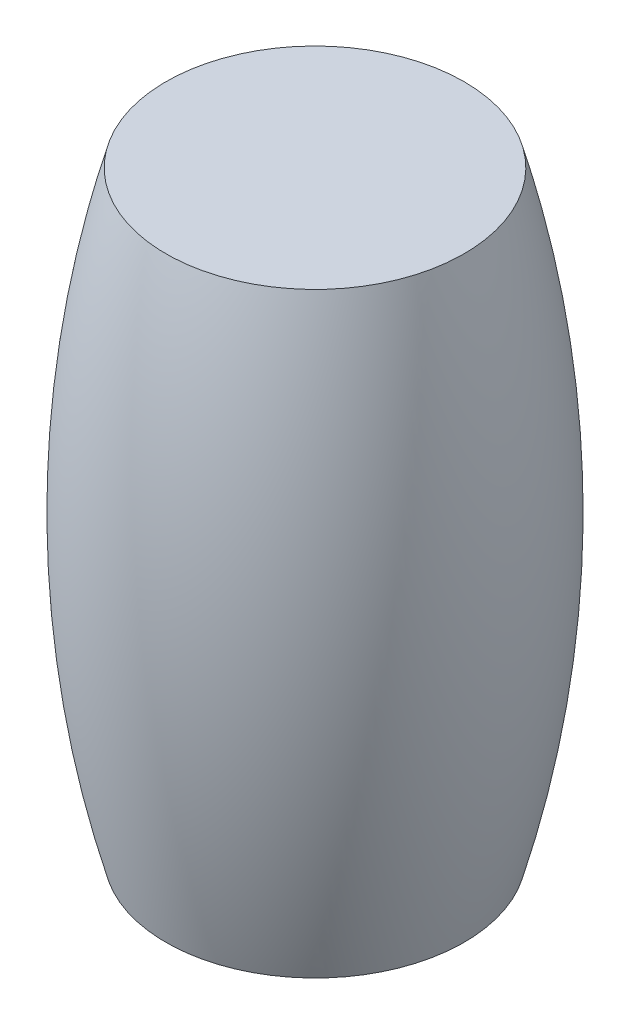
ISO-10303-21;
HEADER;
FILE_DESCRIPTION(('STEP AP214'),'2;1');
FILE_NAME('part.step','',(''),(''),'','','');
FILE_SCHEMA(('AUTOMOTIVE_DESIGN { 1 0 10303 214 1 1 1 1 }'));
ENDSEC;
DATA;
#1=APPLICATION_CONTEXT('core data for automotive mechanical design processes');
#2=APPLICATION_PROTOCOL_DEFINITION('international standard','automotive_design',2000,#1);
#3=PRODUCT_CONTEXT('',#1,'mechanical');
#4=PRODUCT('Part','Part','',(#3));
#5=PRODUCT_RELATED_PRODUCT_CATEGORY('part','',(#4));
#6=PRODUCT_DEFINITION_FORMATION('','',#4);
#7=PRODUCT_DEFINITION_CONTEXT('part definition',#1,'design');
#8=PRODUCT_DEFINITION('design','',#6,#7);
#9=PRODUCT_DEFINITION_SHAPE('','',#8);
#10=(LENGTH_UNIT() NAMED_UNIT(*) SI_UNIT(.MILLI.,.METRE.));
#11=(NAMED_UNIT(*) PLANE_ANGLE_UNIT() SI_UNIT($,.RADIAN.));
#12=(NAMED_UNIT(*) SI_UNIT($,.STERADIAN.) SOLID_ANGLE_UNIT());
#13=UNCERTAINTY_MEASURE_WITH_UNIT(LENGTH_MEASURE(1.E-05),#10,'distance_accuracy_value','');
#14=(GEOMETRIC_REPRESENTATION_CONTEXT(3) GLOBAL_UNCERTAINTY_ASSIGNED_CONTEXT((#13)) GLOBAL_UNIT_ASSIGNED_CONTEXT((#10,
#11,#12)) REPRESENTATION_CONTEXT('',''));
#15=CARTESIAN_POINT('',(0.,0.,0.));
#16=DIRECTION('',(0.,0.,1.));
#17=DIRECTION('',(1.,0.,0.));
#18=AXIS2_PLACEMENT_3D('',#15,#16,#17);
#19=CARTESIAN_POINT('',(0.,80.,0.));
#20=DIRECTION('',(0.,1.,0.));
#21=DIRECTION('',(0.,0.,1.));
#22=AXIS2_PLACEMENT_3D('',#19,#20,#21);
#23=PLANE('',#22);
#24=CARTESIAN_POINT('',(0.,80.,0.));
#25=DIRECTION('',(0.,-1.,0.));
#26=DIRECTION('',(0.,0.,-1.));
#27=AXIS2_PLACEMENT_3D('',#24,#25,#26);
#28=CIRCLE('',#27,20.);
#29=CARTESIAN_POINT('',(0.,80.,-20.));
#30=VERTEX_POINT('',#29);
#31=EDGE_CURVE('E10',#30,#30,#28,.T.);
#32=ORIENTED_EDGE('',*,*,#31,.F.);
#33=EDGE_LOOP('',(#32));
#34=FACE_BOUND('',#33,.T.);
#35=ADVANCED_FACE('F29',(#34),#23,.T.);
#36=CARTESIAN_POINT('',(0.,40.,0.));
#37=DIRECTION('',(0.,-1.,0.));
#38=DIRECTION('',(0.,0.,-1.));
#39=AXIS2_PLACEMENT_3D('',#36,#37,#38);
#40=DEGENERATE_TOROIDAL_SURFACE('',#39,124.56832294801,150.,.F.);
#41=ORIENTED_EDGE('',*,*,#31,.T.);
#42=EDGE_LOOP('',(#41));
#43=FACE_BOUND('',#42,.T.);
#44=CARTESIAN_POINT('',(0.,0.,0.));
#45=DIRECTION('',(0.,-1.,0.));
#46=DIRECTION('',(0.,0.,-1.));
#47=AXIS2_PLACEMENT_3D('',#44,#45,#46);
#48=CIRCLE('',#47,20.);
#49=CARTESIAN_POINT('',(0.,0.,-20.));
#50=VERTEX_POINT('',#49);
#51=EDGE_CURVE('E35',#50,#50,#48,.T.);
#52=ORIENTED_EDGE('',*,*,#51,.F.);
#53=EDGE_LOOP('',(#52));
#54=FACE_BOUND('',#53,.T.);
#55=ADVANCED_FACE('F43',(#43,#54),#40,.F.);
#56=CARTESIAN_POINT('',(0.,0.,0.));
#57=DIRECTION('',(0.,-1.,0.));
#58=DIRECTION('',(0.,0.,-1.));
#59=AXIS2_PLACEMENT_3D('',#56,#57,#58);
#60=PLANE('',#59);
#61=ORIENTED_EDGE('',*,*,#51,.T.);
#62=EDGE_LOOP('',(#61));
#63=FACE_BOUND('',#62,.T.);
#64=ADVANCED_FACE('F41',(#63),#60,.T.);
#65=CLOSED_SHELL('',(#35,#55,#64));
#66=MANIFOLD_SOLID_BREP('B2',#65);
#67=ADVANCED_BREP_SHAPE_REPRESENTATION('',(#18,#66),#14);
#68=SHAPE_DEFINITION_REPRESENTATION(#9,#67);
ENDSEC;
END-ISO-10303-21;
